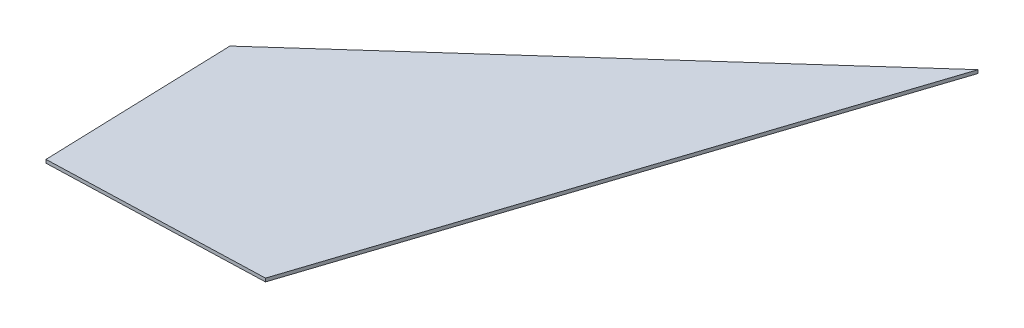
from build123d import *

# Parameters (mm, degrees)
BOSS_EXTRUDE1_DEPTH = 1
BOSS_EXTRUDE2_DEPTH = 1


with BuildPart() as part:
    # Sketch1 → Boss-Extrude1 (new body)
    with BuildSketch(Plane(origin=(0, 0, 0), x_dir=(1, 0, 0), z_dir=(0, 1, 0))):
        Polygon((55.848969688, 77.010858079), (-55.848969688, -23.106924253), (-54.088384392, -77.010858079), (6.062983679, -75.046221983), align=None)
    extrude(amount=-BOSS_EXTRUDE1_DEPTH)

    # Sketch2 → Boss-Extrude2 (add)
    with BuildSketch(Plane(origin=(0, 0, 0), x_dir=(-1, 0, 0), z_dir=(0, 1, 0))):
        Polygon((-7.527940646, 76.999440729), (-60.072231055, -83.48209261), (57.878348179, 22.240094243), (56.022030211, 79.075080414), align=None)
    extrude(amount=BOSS_EXTRUDE2_DEPTH)


solid = part.part
